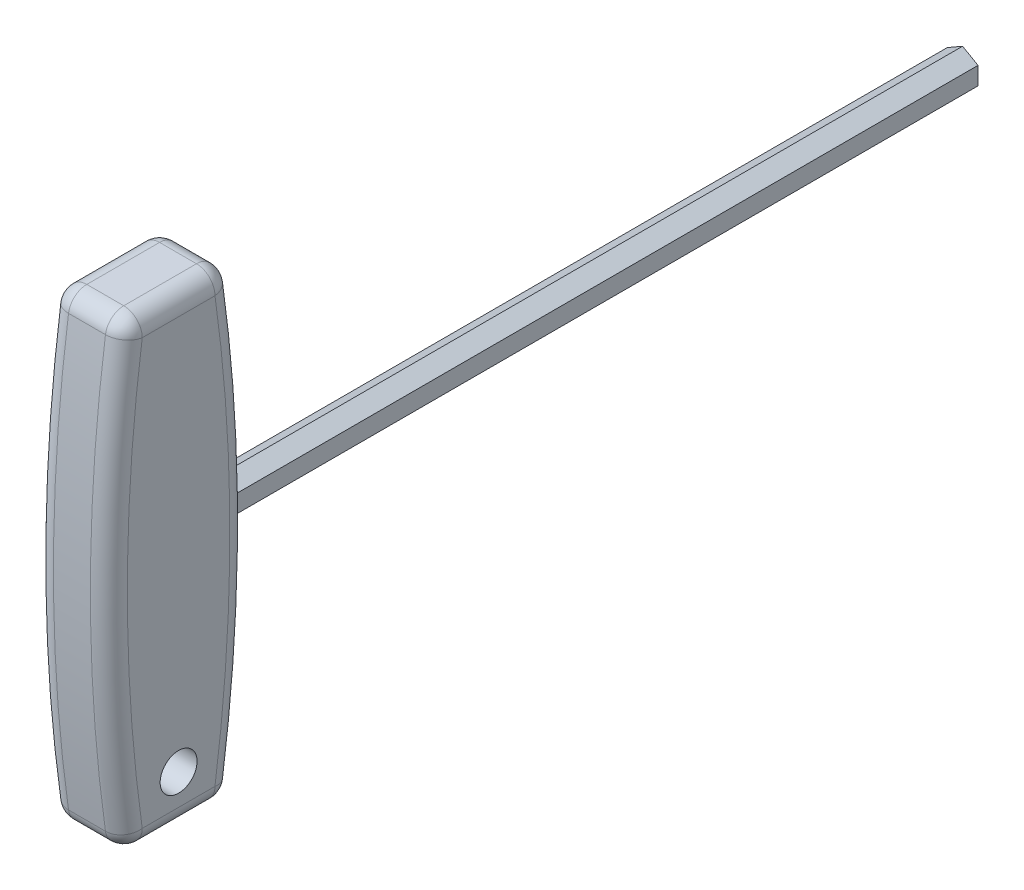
ISO-10303-21;
HEADER;
FILE_DESCRIPTION(('STEP AP214'),'2;1');
FILE_NAME('part.step','',(''),(''),'','','');
FILE_SCHEMA(('AUTOMOTIVE_DESIGN { 1 0 10303 214 1 1 1 1 }'));
ENDSEC;
DATA;
#1=APPLICATION_CONTEXT('core data for automotive mechanical design processes');
#2=APPLICATION_PROTOCOL_DEFINITION('international standard','automotive_design',2000,#1);
#3=PRODUCT_CONTEXT('',#1,'mechanical');
#4=PRODUCT('Part','Part','',(#3));
#5=PRODUCT_RELATED_PRODUCT_CATEGORY('part','',(#4));
#6=PRODUCT_DEFINITION_FORMATION('','',#4);
#7=PRODUCT_DEFINITION_CONTEXT('part definition',#1,'design');
#8=PRODUCT_DEFINITION('design','',#6,#7);
#9=PRODUCT_DEFINITION_SHAPE('','',#8);
#10=(LENGTH_UNIT() NAMED_UNIT(*) SI_UNIT(.MILLI.,.METRE.));
#11=(NAMED_UNIT(*) PLANE_ANGLE_UNIT() SI_UNIT($,.RADIAN.));
#12=(NAMED_UNIT(*) SI_UNIT($,.STERADIAN.) SOLID_ANGLE_UNIT());
#13=UNCERTAINTY_MEASURE_WITH_UNIT(LENGTH_MEASURE(1.E-05),#10,'distance_accuracy_value','');
#14=(GEOMETRIC_REPRESENTATION_CONTEXT(3) GLOBAL_UNCERTAINTY_ASSIGNED_CONTEXT((#13)) GLOBAL_UNIT_ASSIGNED_CONTEXT((#10,
#11,#12)) REPRESENTATION_CONTEXT('',''));
#15=CARTESIAN_POINT('',(0.,0.,0.));
#16=DIRECTION('',(0.,0.,1.));
#17=DIRECTION('',(1.,0.,0.));
#18=AXIS2_PLACEMENT_3D('',#15,#16,#17);
#19=CARTESIAN_POINT('',(0.,0.,0.));
#20=DIRECTION('',(0.,0.,1.));
#21=DIRECTION('',(1.,0.,0.));
#22=AXIS2_PLACEMENT_3D('',#19,#20,#21);
#23=PLANE('',#22);
#24=DIRECTION('',(-0.866025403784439,-0.5,0.));
#25=VECTOR('',#24,1.);
#26=CARTESIAN_POINT('',(-2.5,1.44337567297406,0.));
#27=LINE('',#26,#25);
#28=CARTESIAN_POINT('',(0.,2.88675134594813,0.));
#29=VERTEX_POINT('',#28);
#30=CARTESIAN_POINT('',(-2.5,1.44337567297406,0.));
#31=VERTEX_POINT('',#30);
#32=EDGE_CURVE('E144',#29,#31,#27,.T.);
#33=ORIENTED_EDGE('',*,*,#32,.F.);
#34=DIRECTION('',(-0.866025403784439,0.5,0.));
#35=VECTOR('',#34,1.);
#36=CARTESIAN_POINT('',(0.,2.88675134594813,0.));
#37=LINE('',#36,#35);
#38=CARTESIAN_POINT('',(2.5,1.44337567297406,0.));
#39=VERTEX_POINT('',#38);
#40=EDGE_CURVE('E312',#39,#29,#37,.T.);
#41=ORIENTED_EDGE('',*,*,#40,.F.);
#42=DIRECTION('',(0.,1.,0.));
#43=VECTOR('',#42,1.);
#44=CARTESIAN_POINT('',(2.5,1.44337567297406,0.));
#45=LINE('',#44,#43);
#46=CARTESIAN_POINT('',(2.5,-1.44337567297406,0.));
#47=VERTEX_POINT('',#46);
#48=EDGE_CURVE('E316',#47,#39,#45,.T.);
#49=ORIENTED_EDGE('',*,*,#48,.F.);
#50=DIRECTION('',(0.866025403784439,0.5,0.));
#51=VECTOR('',#50,1.);
#52=CARTESIAN_POINT('',(2.5,-1.44337567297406,0.));
#53=LINE('',#52,#51);
#54=CARTESIAN_POINT('',(0.,-2.88675134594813,0.));
#55=VERTEX_POINT('',#54);
#56=EDGE_CURVE('E320',#55,#47,#53,.T.);
#57=ORIENTED_EDGE('',*,*,#56,.F.);
#58=DIRECTION('',(0.866025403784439,-0.5,0.));
#59=VECTOR('',#58,1.);
#60=CARTESIAN_POINT('',(0.,-2.88675134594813,0.));
#61=LINE('',#60,#59);
#62=CARTESIAN_POINT('',(-2.5,-1.44337567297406,0.));
#63=VERTEX_POINT('',#62);
#64=EDGE_CURVE('E324',#63,#55,#61,.T.);
#65=ORIENTED_EDGE('',*,*,#64,.F.);
#66=DIRECTION('',(0.,1.,0.));
#67=VECTOR('',#66,1.);
#68=CARTESIAN_POINT('',(-2.5,-1.44337567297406,0.));
#69=LINE('',#68,#67);
#70=EDGE_CURVE('E147',#31,#63,#69,.F.);
#71=ORIENTED_EDGE('',*,*,#70,.F.);
#72=EDGE_LOOP('',(#33,#41,#49,#57,#65,#71));
#73=FACE_BOUND('',#72,.T.);
#74=ADVANCED_FACE('F15',(#73),#23,.F.);
#75=CARTESIAN_POINT('',(-3.,-34.4999999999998,127.404449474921));
#76=DIRECTION('',(1.,0.,0.));
#77=DIRECTION('',(0.,1.,0.));
#78=AXIS2_PLACEMENT_3D('',#75,#76,#77);
#79=SPHERICAL_SURFACE('',#78,3.);
#80=CARTESIAN_POINT('',(-3.,-34.4999999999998,127.404449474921));
#81=DIRECTION('',(-1.,0.,0.));
#82=DIRECTION('',(0.,0.,1.));
#83=AXIS2_PLACEMENT_3D('',#80,#81,#82);
#84=CIRCLE('',#83,3.);
#85=CARTESIAN_POINT('',(-3.,-37.4999999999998,127.404449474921));
#86=VERTEX_POINT('',#85);
#87=CARTESIAN_POINT('',(-3.,-34.9190000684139,124.433853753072));
#88=VERTEX_POINT('',#87);
#89=EDGE_CURVE('E326',#86,#88,#84,.F.);
#90=ORIENTED_EDGE('',*,*,#89,.F.);
#91=CARTESIAN_POINT('',(-3.,-34.4999999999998,127.404449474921));
#92=DIRECTION('',(0.,0.,-1.));
#93=DIRECTION('',(-1.,0.,0.));
#94=AXIS2_PLACEMENT_3D('',#91,#92,#93);
#95=CIRCLE('',#94,3.);
#96=CARTESIAN_POINT('',(-6.,-34.4999999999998,127.404449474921));
#97=VERTEX_POINT('',#96);
#98=EDGE_CURVE('E292',#97,#86,#95,.F.);
#99=ORIENTED_EDGE('',*,*,#98,.F.);
#100=CARTESIAN_POINT('',(-3.,-34.4999999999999,127.404449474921));
#101=DIRECTION('',(0.,0.990198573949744,-0.139666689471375));
#102=DIRECTION('',(0.,-0.139666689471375,-0.990198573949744));
#103=AXIS2_PLACEMENT_3D('',#100,#101,#102);
#104=CIRCLE('',#103,3.);
#105=EDGE_CURVE('E258',#88,#97,#104,.T.);
#106=ORIENTED_EDGE('',*,*,#105,.F.);
#107=EDGE_LOOP('',(#90,#99,#106));
#108=FACE_BOUND('',#107,.T.);
#109=ADVANCED_FACE('F356',(#108),#79,.T.);
#110=CARTESIAN_POINT('',(-3.,34.5000000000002,127.404449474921));
#111=DIRECTION('',(1.,0.,0.));
#112=DIRECTION('',(0.,1.,0.));
#113=AXIS2_PLACEMENT_3D('',#110,#111,#112);
#114=SPHERICAL_SURFACE('',#113,2.99999999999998);
#115=CARTESIAN_POINT('',(-3.,34.5000000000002,127.404449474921));
#116=DIRECTION('',(1.,0.,0.));
#117=DIRECTION('',(0.,0.,-1.));
#118=AXIS2_PLACEMENT_3D('',#115,#116,#117);
#119=CIRCLE('',#118,3.);
#120=CARTESIAN_POINT('',(-3.,34.9190000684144,124.433853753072));
#121=VERTEX_POINT('',#120);
#122=CARTESIAN_POINT('',(-3.,37.5000000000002,127.404449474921));
#123=VERTEX_POINT('',#122);
#124=EDGE_CURVE('E300',#121,#123,#119,.T.);
#125=ORIENTED_EDGE('',*,*,#124,.F.);
#126=CARTESIAN_POINT('',(-3.,34.5000000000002,127.404449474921));
#127=DIRECTION('',(0.,0.990198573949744,0.139666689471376));
#128=DIRECTION('',(0.,0.139666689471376,-0.990198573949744));
#129=AXIS2_PLACEMENT_3D('',#126,#127,#128);
#130=CIRCLE('',#129,3.);
#131=CARTESIAN_POINT('',(-6.,34.5000000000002,127.404449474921));
#132=VERTEX_POINT('',#131);
#133=EDGE_CURVE('E282',#132,#121,#130,.F.);
#134=ORIENTED_EDGE('',*,*,#133,.F.);
#135=CARTESIAN_POINT('',(-3.,34.5000000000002,127.404449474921));
#136=DIRECTION('',(0.,0.,1.));
#137=DIRECTION('',(1.,0.,0.));
#138=AXIS2_PLACEMENT_3D('',#135,#136,#137);
#139=CIRCLE('',#138,3.);
#140=EDGE_CURVE('E248',#123,#132,#139,.T.);
#141=ORIENTED_EDGE('',*,*,#140,.F.);
#142=EDGE_LOOP('',(#125,#134,#141));
#143=FACE_BOUND('',#142,.T.);
#144=ADVANCED_FACE('F353',(#143),#114,.T.);
#145=CARTESIAN_POINT('',(-3.,-34.4999999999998,139.21883856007));
#146=DIRECTION('',(1.,0.,0.));
#147=DIRECTION('',(0.,1.,0.));
#148=AXIS2_PLACEMENT_3D('',#145,#146,#147);
#149=SPHERICAL_SURFACE('',#148,2.99999999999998);
#150=CARTESIAN_POINT('',(-3.,-34.4999999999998,139.21883856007));
#151=DIRECTION('',(1.,0.,0.));
#152=DIRECTION('',(0.,0.,-1.));
#153=AXIS2_PLACEMENT_3D('',#150,#151,#152);
#154=CIRCLE('',#153,3.);
#155=CARTESIAN_POINT('',(-3.,-34.9190000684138,142.189434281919));
#156=VERTEX_POINT('',#155);
#157=CARTESIAN_POINT('',(-3.,-37.4999999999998,139.21883856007));
#158=VERTEX_POINT('',#157);
#159=EDGE_CURVE('E329',#156,#158,#154,.T.);
#160=ORIENTED_EDGE('',*,*,#159,.F.);
#161=CARTESIAN_POINT('',(-3.,-34.4999999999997,139.21883856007));
#162=DIRECTION('',(0.,-0.990198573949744,-0.139666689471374));
#163=DIRECTION('',(0.,-0.139666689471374,0.990198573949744));
#164=AXIS2_PLACEMENT_3D('',#161,#162,#163);
#165=CIRCLE('',#164,3.);
#166=CARTESIAN_POINT('',(-6.,-34.4999999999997,139.21883856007));
#167=VERTEX_POINT('',#166);
#168=EDGE_CURVE('E243',#167,#156,#165,.F.);
#169=ORIENTED_EDGE('',*,*,#168,.F.);
#170=CARTESIAN_POINT('',(-3.,-34.4999999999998,139.21883856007));
#171=DIRECTION('',(0.,0.,-1.));
#172=DIRECTION('',(-1.,0.,0.));
#173=AXIS2_PLACEMENT_3D('',#170,#171,#172);
#174=CIRCLE('',#173,3.);
#175=EDGE_CURVE('E287',#158,#167,#174,.T.);
#176=ORIENTED_EDGE('',*,*,#175,.F.);
#177=EDGE_LOOP('',(#160,#169,#176));
#178=FACE_BOUND('',#177,.T.);
#179=ADVANCED_FACE('F348',(#178),#149,.T.);
#180=CARTESIAN_POINT('',(-3.,34.5000000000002,139.21883856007));
#181=DIRECTION('',(1.,0.,0.));
#182=DIRECTION('',(0.,1.,0.));
#183=AXIS2_PLACEMENT_3D('',#180,#181,#182);
#184=SPHERICAL_SURFACE('',#183,3.);
#185=CARTESIAN_POINT('',(-3.,34.5000000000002,139.21883856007));
#186=DIRECTION('',(1.,0.,0.));
#187=DIRECTION('',(0.,0.,-1.));
#188=AXIS2_PLACEMENT_3D('',#185,#186,#187);
#189=CIRCLE('',#188,3.);
#190=CARTESIAN_POINT('',(-3.,37.5000000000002,139.21883856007));
#191=VERTEX_POINT('',#190);
#192=CARTESIAN_POINT('',(-3.,34.9190000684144,142.189434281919));
#193=VERTEX_POINT('',#192);
#194=EDGE_CURVE('E297',#191,#193,#189,.T.);
#195=ORIENTED_EDGE('',*,*,#194,.F.);
#196=CARTESIAN_POINT('',(-3.,34.5000000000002,139.21883856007));
#197=DIRECTION('',(0.,0.,1.));
#198=DIRECTION('',(1.,0.,0.));
#199=AXIS2_PLACEMENT_3D('',#196,#197,#198);
#200=CIRCLE('',#199,3.);
#201=CARTESIAN_POINT('',(-6.,34.5000000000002,139.21883856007));
#202=VERTEX_POINT('',#201);
#203=EDGE_CURVE('E253',#202,#191,#200,.F.);
#204=ORIENTED_EDGE('',*,*,#203,.F.);
#205=CARTESIAN_POINT('',(-3.,34.5000000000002,139.21883856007));
#206=DIRECTION('',(0.,-0.990198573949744,0.139666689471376));
#207=DIRECTION('',(0.,0.139666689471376,0.990198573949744));
#208=AXIS2_PLACEMENT_3D('',#205,#206,#207);
#209=CIRCLE('',#208,3.);
#210=EDGE_CURVE('E221',#193,#202,#209,.T.);
#211=ORIENTED_EDGE('',*,*,#210,.F.);
#212=EDGE_LOOP('',(#195,#204,#211));
#213=FACE_BOUND('',#212,.T.);
#214=ADVANCED_FACE('F343',(#213),#184,.T.);
#215=CARTESIAN_POINT('',(0.,-34.4999999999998,139.21883856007));
#216=DIRECTION('',(1.,0.,0.));
#217=DIRECTION('',(0.,0.,-1.));
#218=AXIS2_PLACEMENT_3D('',#215,#216,#217);
#219=CYLINDRICAL_SURFACE('',#218,3.);
#220=ORIENTED_EDGE('',*,*,#159,.T.);
#221=DIRECTION('',(1.,0.,0.));
#222=VECTOR('',#221,1.);
#223=CARTESIAN_POINT('',(0.,-37.4999999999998,139.21883856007));
#224=LINE('',#223,#222);
#225=CARTESIAN_POINT('',(3.,-37.4999999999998,139.21883856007));
#226=VERTEX_POINT('',#225);
#227=EDGE_CURVE('E204',#226,#158,#224,.F.);
#228=ORIENTED_EDGE('',*,*,#227,.F.);
#229=CARTESIAN_POINT('',(3.,-34.4999999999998,139.21883856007));
#230=DIRECTION('',(1.,0.,0.));
#231=DIRECTION('',(0.,1.,0.));
#232=AXIS2_PLACEMENT_3D('',#229,#230,#231);
#233=CIRCLE('',#232,3.);
#234=CARTESIAN_POINT('',(3.,-34.9190000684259,142.189434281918));
#235=VERTEX_POINT('',#234);
#236=EDGE_CURVE('E206',#235,#226,#233,.T.);
#237=ORIENTED_EDGE('',*,*,#236,.F.);
#238=DIRECTION('',(1.,0.,0.));
#239=VECTOR('',#238,1.);
#240=CARTESIAN_POINT('',(0.,-34.9190000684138,142.189434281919));
#241=LINE('',#240,#239);
#242=EDGE_CURVE('E209',#156,#235,#241,.T.);
#243=ORIENTED_EDGE('',*,*,#242,.F.);
#244=EDGE_LOOP('',(#220,#228,#237,#243));
#245=FACE_BOUND('',#244,.T.);
#246=ADVANCED_FACE('F347',(#245),#219,.T.);
#247=CARTESIAN_POINT('',(0.,-34.4999999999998,127.404449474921));
#248=DIRECTION('',(-1.,0.,0.));
#249=DIRECTION('',(0.,0.,1.));
#250=AXIS2_PLACEMENT_3D('',#247,#248,#249);
#251=CYLINDRICAL_SURFACE('',#250,3.);
#252=CARTESIAN_POINT('',(3.,-34.4999999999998,127.404449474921));
#253=DIRECTION('',(1.,0.,0.));
#254=DIRECTION('',(0.,1.,0.));
#255=AXIS2_PLACEMENT_3D('',#252,#253,#254);
#256=CIRCLE('',#255,3.);
#257=CARTESIAN_POINT('',(3.,-37.4999999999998,127.404449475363));
#258=VERTEX_POINT('',#257);
#259=CARTESIAN_POINT('',(3.,-34.9190000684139,124.433853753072));
#260=VERTEX_POINT('',#259);
#261=EDGE_CURVE('E179',#258,#260,#256,.T.);
#262=ORIENTED_EDGE('',*,*,#261,.F.);
#263=DIRECTION('',(1.,0.,0.));
#264=VECTOR('',#263,1.);
#265=CARTESIAN_POINT('',(0.,-37.4999999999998,127.404449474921));
#266=LINE('',#265,#264);
#267=EDGE_CURVE('E333',#86,#258,#266,.T.);
#268=ORIENTED_EDGE('',*,*,#267,.F.);
#269=ORIENTED_EDGE('',*,*,#89,.T.);
#270=DIRECTION('',(1.,0.,0.));
#271=VECTOR('',#270,1.);
#272=CARTESIAN_POINT('',(0.,-34.9190000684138,124.433853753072));
#273=LINE('',#272,#271);
#274=EDGE_CURVE('E171',#260,#88,#273,.F.);
#275=ORIENTED_EDGE('',*,*,#274,.F.);
#276=EDGE_LOOP('',(#262,#268,#269,#275));
#277=FACE_BOUND('',#276,.T.);
#278=ADVANCED_FACE('F596',(#277),#251,.T.);
#279=CARTESIAN_POINT('',(-2.5,1.44337567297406,0.));
#280=DIRECTION('',(-0.5,0.866025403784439,0.));
#281=DIRECTION('',(-0.866025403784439,-0.5,0.));
#282=AXIS2_PLACEMENT_3D('',#279,#280,#281);
#283=PLANE('',#282);
#284=ORIENTED_EDGE('',*,*,#32,.T.);
#285=DIRECTION('',(0.,0.,1.));
#286=VECTOR('',#285,1.);
#287=CARTESIAN_POINT('',(-2.5,1.44337567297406,0.));
#288=LINE('',#287,#286);
#289=CARTESIAN_POINT('',(-2.5,1.44337567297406,121.987500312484));
#290=VERTEX_POINT('',#289);
#291=EDGE_CURVE('E141',#290,#31,#288,.F.);
#292=ORIENTED_EDGE('',*,*,#291,.F.);
#293=CARTESIAN_POINT('',(-5.,0.,372.));
#294=DIRECTION('',(-0.5,0.866025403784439,0.));
#295=DIRECTION('',(0.866025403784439,0.5,0.));
#296=AXIS2_PLACEMENT_3D('',#293,#294,#295);
#297=ELLIPSE('',#296,500.033332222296,250.016666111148);
#298=CARTESIAN_POINT('',(0.,2.88675134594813,122.));
#299=VERTEX_POINT('',#298);
#300=EDGE_CURVE('E18',#299,#290,#297,.T.);
#301=ORIENTED_EDGE('',*,*,#300,.F.);
#302=DIRECTION('',(0.,0.,1.));
#303=VECTOR('',#302,1.);
#304=CARTESIAN_POINT('',(0.,2.88675134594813,0.));
#305=LINE('',#304,#303);
#306=EDGE_CURVE('E303',#29,#299,#305,.T.);
#307=ORIENTED_EDGE('',*,*,#306,.F.);
#308=EDGE_LOOP('',(#284,#292,#301,#307));
#309=FACE_BOUND('',#308,.T.);
#310=ADVANCED_FACE('F143',(#309),#283,.T.);
#311=CARTESIAN_POINT('',(-2.5,-1.44337567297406,0.));
#312=DIRECTION('',(-1.,0.,0.));
#313=DIRECTION('',(0.,0.,1.));
#314=AXIS2_PLACEMENT_3D('',#311,#312,#313);
#315=PLANE('',#314);
#316=ORIENTED_EDGE('',*,*,#70,.T.);
#317=DIRECTION('',(0.,0.,1.));
#318=VECTOR('',#317,1.);
#319=CARTESIAN_POINT('',(-2.5,-1.44337567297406,0.));
#320=LINE('',#319,#318);
#321=CARTESIAN_POINT('',(-2.5,-1.44337567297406,121.987500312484));
#322=VERTEX_POINT('',#321);
#323=EDGE_CURVE('E153',#322,#63,#320,.F.);
#324=ORIENTED_EDGE('',*,*,#323,.F.);
#325=CARTESIAN_POINT('',(-2.5,0.,372.));
#326=DIRECTION('',(1.,0.,0.));
#327=DIRECTION('',(0.,0.,-1.));
#328=AXIS2_PLACEMENT_3D('',#325,#326,#327);
#329=CIRCLE('',#328,250.016666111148);
#330=EDGE_CURVE('E150',#290,#322,#329,.F.);
#331=ORIENTED_EDGE('',*,*,#330,.F.);
#332=ORIENTED_EDGE('',*,*,#291,.T.);
#333=EDGE_LOOP('',(#316,#324,#331,#332));
#334=FACE_BOUND('',#333,.T.);
#335=ADVANCED_FACE('F151',(#334),#315,.T.);
#336=CARTESIAN_POINT('',(0.,-2.88675134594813,0.));
#337=DIRECTION('',(-0.5,-0.866025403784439,0.));
#338=DIRECTION('',(0.866025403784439,-0.5,0.));
#339=AXIS2_PLACEMENT_3D('',#336,#337,#338);
#340=PLANE('',#339);
#341=ORIENTED_EDGE('',*,*,#64,.T.);
#342=DIRECTION('',(0.,0.,1.));
#343=VECTOR('',#342,1.);
#344=CARTESIAN_POINT('',(0.,-2.88675134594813,0.));
#345=LINE('',#344,#343);
#346=CARTESIAN_POINT('',(0.,-2.88675134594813,122.));
#347=VERTEX_POINT('',#346);
#348=EDGE_CURVE('E321',#347,#55,#345,.F.);
#349=ORIENTED_EDGE('',*,*,#348,.F.);
#350=CARTESIAN_POINT('',(-5.,0.,372.));
#351=DIRECTION('',(-0.5,-0.866025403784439,0.));
#352=DIRECTION('',(0.866025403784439,-0.5,0.));
#353=AXIS2_PLACEMENT_3D('',#350,#351,#352);
#354=ELLIPSE('',#353,500.033332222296,250.016666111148);
#355=EDGE_CURVE('E157',#322,#347,#354,.T.);
#356=ORIENTED_EDGE('',*,*,#355,.F.);
#357=ORIENTED_EDGE('',*,*,#323,.T.);
#358=EDGE_LOOP('',(#341,#349,#356,#357));
#359=FACE_BOUND('',#358,.T.);
#360=ADVANCED_FACE('F383',(#359),#340,.T.);
#361=CARTESIAN_POINT('',(2.5,-1.44337567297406,0.));
#362=DIRECTION('',(0.5,-0.866025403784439,0.));
#363=DIRECTION('',(0.866025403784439,0.5,0.));
#364=AXIS2_PLACEMENT_3D('',#361,#362,#363);
#365=PLANE('',#364);
#366=ORIENTED_EDGE('',*,*,#56,.T.);
#367=DIRECTION('',(0.,0.,-1.));
#368=VECTOR('',#367,1.);
#369=CARTESIAN_POINT('',(2.5,-1.44337567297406,0.));
#370=LINE('',#369,#368);
#371=CARTESIAN_POINT('',(2.5,-1.44337567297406,121.987500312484));
#372=VERTEX_POINT('',#371);
#373=EDGE_CURVE('E317',#372,#47,#370,.T.);
#374=ORIENTED_EDGE('',*,*,#373,.F.);
#375=CARTESIAN_POINT('',(5.,0.,372.));
#376=DIRECTION('',(0.5,-0.866025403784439,0.));
#377=DIRECTION('',(0.866025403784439,0.5,0.));
#378=AXIS2_PLACEMENT_3D('',#375,#376,#377);
#379=ELLIPSE('',#378,500.033332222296,250.016666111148);
#380=EDGE_CURVE('E378',#347,#372,#379,.T.);
#381=ORIENTED_EDGE('',*,*,#380,.F.);
#382=ORIENTED_EDGE('',*,*,#348,.T.);
#383=EDGE_LOOP('',(#366,#374,#381,#382));
#384=FACE_BOUND('',#383,.T.);
#385=ADVANCED_FACE('F387',(#384),#365,.T.);
#386=CARTESIAN_POINT('',(2.5,1.44337567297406,0.));
#387=DIRECTION('',(1.,0.,0.));
#388=DIRECTION('',(0.,0.,-1.));
#389=AXIS2_PLACEMENT_3D('',#386,#387,#388);
#390=PLANE('',#389);
#391=ORIENTED_EDGE('',*,*,#48,.T.);
#392=DIRECTION('',(0.,0.,1.));
#393=VECTOR('',#392,1.);
#394=CARTESIAN_POINT('',(2.5,1.44337567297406,0.));
#395=LINE('',#394,#393);
#396=CARTESIAN_POINT('',(2.5,1.44337567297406,121.987500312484));
#397=VERTEX_POINT('',#396);
#398=EDGE_CURVE('E313',#397,#39,#395,.F.);
#399=ORIENTED_EDGE('',*,*,#398,.F.);
#400=CARTESIAN_POINT('',(2.5,0.,372.));
#401=DIRECTION('',(1.,0.,0.));
#402=DIRECTION('',(0.,0.,-1.));
#403=AXIS2_PLACEMENT_3D('',#400,#401,#402);
#404=CIRCLE('',#403,250.016666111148);
#405=EDGE_CURVE('E376',#372,#397,#404,.T.);
#406=ORIENTED_EDGE('',*,*,#405,.F.);
#407=ORIENTED_EDGE('',*,*,#373,.T.);
#408=EDGE_LOOP('',(#391,#399,#406,#407));
#409=FACE_BOUND('',#408,.T.);
#410=ADVANCED_FACE('F391',(#409),#390,.T.);
#411=CARTESIAN_POINT('',(0.,2.88675134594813,0.));
#412=DIRECTION('',(0.5,0.866025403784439,0.));
#413=DIRECTION('',(-0.866025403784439,0.5,0.));
#414=AXIS2_PLACEMENT_3D('',#411,#412,#413);
#415=PLANE('',#414);
#416=ORIENTED_EDGE('',*,*,#40,.T.);
#417=ORIENTED_EDGE('',*,*,#306,.T.);
#418=CARTESIAN_POINT('',(5.,0.,372.));
#419=DIRECTION('',(0.5,0.866025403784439,0.));
#420=DIRECTION('',(0.866025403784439,-0.5,0.));
#421=AXIS2_PLACEMENT_3D('',#418,#419,#420);
#422=ELLIPSE('',#421,500.033332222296,250.016666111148);
#423=EDGE_CURVE('E163',#397,#299,#422,.T.);
#424=ORIENTED_EDGE('',*,*,#423,.F.);
#425=ORIENTED_EDGE('',*,*,#398,.T.);
#426=EDGE_LOOP('',(#416,#417,#424,#425));
#427=FACE_BOUND('',#426,.T.);
#428=ADVANCED_FACE('F394',(#427),#415,.T.);
#429=CARTESIAN_POINT('',(0.,34.5000000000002,127.404449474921));
#430=DIRECTION('',(1.,0.,0.));
#431=DIRECTION('',(0.,0.,-1.));
#432=AXIS2_PLACEMENT_3D('',#429,#430,#431);
#433=CYLINDRICAL_SURFACE('',#432,3.);
#434=ORIENTED_EDGE('',*,*,#124,.T.);
#435=DIRECTION('',(1.,0.,0.));
#436=VECTOR('',#435,1.);
#437=CARTESIAN_POINT('',(0.,37.5000000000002,127.404449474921));
#438=LINE('',#437,#436);
#439=CARTESIAN_POINT('',(3.,37.5000000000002,127.404449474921));
#440=VERTEX_POINT('',#439);
#441=EDGE_CURVE('E308',#440,#123,#438,.F.);
#442=ORIENTED_EDGE('',*,*,#441,.F.);
#443=CARTESIAN_POINT('',(3.,34.5000000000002,127.404449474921));
#444=DIRECTION('',(1.,0.,0.));
#445=DIRECTION('',(0.,1.,0.));
#446=AXIS2_PLACEMENT_3D('',#443,#444,#445);
#447=CIRCLE('',#446,3.);
#448=CARTESIAN_POINT('',(3.,34.919000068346,124.433853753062));
#449=VERTEX_POINT('',#448);
#450=EDGE_CURVE('E375',#449,#440,#447,.T.);
#451=ORIENTED_EDGE('',*,*,#450,.F.);
#452=DIRECTION('',(1.,0.,0.));
#453=VECTOR('',#452,1.);
#454=CARTESIAN_POINT('',(0.,34.9190000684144,124.433853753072));
#455=LINE('',#454,#453);
#456=EDGE_CURVE('E164',#121,#449,#455,.T.);
#457=ORIENTED_EDGE('',*,*,#456,.F.);
#458=EDGE_LOOP('',(#434,#442,#451,#457));
#459=FACE_BOUND('',#458,.T.);
#460=ADVANCED_FACE('F580',(#459),#433,.T.);
#461=CARTESIAN_POINT('',(0.,34.5000000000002,139.21883856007));
#462=DIRECTION('',(1.,0.,0.));
#463=DIRECTION('',(0.,0.,-1.));
#464=AXIS2_PLACEMENT_3D('',#461,#462,#463);
#465=CYLINDRICAL_SURFACE('',#464,3.);
#466=ORIENTED_EDGE('',*,*,#194,.T.);
#467=DIRECTION('',(1.,0.,0.));
#468=VECTOR('',#467,1.);
#469=CARTESIAN_POINT('',(0.,34.9190000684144,142.189434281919));
#470=LINE('',#469,#468);
#471=CARTESIAN_POINT('',(3.,34.9190000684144,142.189434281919));
#472=VERTEX_POINT('',#471);
#473=EDGE_CURVE('E218',#472,#193,#470,.F.);
#474=ORIENTED_EDGE('',*,*,#473,.F.);
#475=CARTESIAN_POINT('',(3.,34.5000000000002,139.21883856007));
#476=DIRECTION('',(1.,0.,0.));
#477=DIRECTION('',(0.,1.,0.));
#478=AXIS2_PLACEMENT_3D('',#475,#476,#477);
#479=CIRCLE('',#478,3.);
#480=CARTESIAN_POINT('',(3.,37.5000000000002,139.21883856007));
#481=VERTEX_POINT('',#480);
#482=EDGE_CURVE('E307',#481,#472,#479,.T.);
#483=ORIENTED_EDGE('',*,*,#482,.F.);
#484=DIRECTION('',(1.,0.,0.));
#485=VECTOR('',#484,1.);
#486=CARTESIAN_POINT('',(0.,37.5000000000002,139.21883856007));
#487=LINE('',#486,#485);
#488=EDGE_CURVE('E569',#191,#481,#487,.T.);
#489=ORIENTED_EDGE('',*,*,#488,.F.);
#490=EDGE_LOOP('',(#466,#474,#483,#489));
#491=FACE_BOUND('',#490,.T.);
#492=ADVANCED_FACE('F584',(#491),#465,.T.);
#493=CARTESIAN_POINT('',(-3.,-34.4999999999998,129.061644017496));
#494=DIRECTION('',(0.,0.,-1.));
#495=DIRECTION('',(-1.,0.,0.));
#496=AXIS2_PLACEMENT_3D('',#493,#494,#495);
#497=CYLINDRICAL_SURFACE('',#496,3.);
#498=ORIENTED_EDGE('',*,*,#175,.T.);
#499=DIRECTION('',(0.,0.,-1.));
#500=VECTOR('',#499,1.);
#501=CARTESIAN_POINT('',(-6.,-34.4999999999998,133.311644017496));
#502=LINE('',#501,#500);
#503=EDGE_CURVE('E548',#167,#97,#502,.T.);
#504=ORIENTED_EDGE('',*,*,#503,.T.);
#505=ORIENTED_EDGE('',*,*,#98,.T.);
#506=DIRECTION('',(0.,0.,-1.));
#507=VECTOR('',#506,1.);
#508=CARTESIAN_POINT('',(-3.,-37.4999999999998,124.811644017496));
#509=LINE('',#508,#507);
#510=EDGE_CURVE('E330',#158,#86,#509,.T.);
#511=ORIENTED_EDGE('',*,*,#510,.F.);
#512=EDGE_LOOP('',(#498,#504,#505,#511));
#513=FACE_BOUND('',#512,.T.);
#514=ADVANCED_FACE('F269',(#513),#497,.T.);
#515=CARTESIAN_POINT('',(-3.,0.,372.));
#516=DIRECTION('',(1.,0.,0.));
#517=DIRECTION('',(0.,0.,-1.));
#518=AXIS2_PLACEMENT_3D('',#515,#516,#517);
#519=TOROIDAL_SURFACE('',#518,247.016666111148,3.);
#520=ORIENTED_EDGE('',*,*,#105,.T.);
#521=CARTESIAN_POINT('',(-6.,0.,372.));
#522=DIRECTION('',(1.,0.,0.));
#523=DIRECTION('',(0.,-0.139666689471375,-0.990198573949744));
#524=AXIS2_PLACEMENT_3D('',#521,#522,#523);
#525=CIRCLE('',#524,247.016666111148);
#526=EDGE_CURVE('E524',#97,#132,#525,.T.);
#527=ORIENTED_EDGE('',*,*,#526,.T.);
#528=ORIENTED_EDGE('',*,*,#133,.T.);
#529=CARTESIAN_POINT('',(-3.,0.,372.));
#530=DIRECTION('',(1.,0.,0.));
#531=DIRECTION('',(0.,0.,-1.));
#532=AXIS2_PLACEMENT_3D('',#529,#530,#531);
#533=CIRCLE('',#532,250.016666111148);
#534=EDGE_CURVE('E166',#88,#121,#533,.T.);
#535=ORIENTED_EDGE('',*,*,#534,.F.);
#536=EDGE_LOOP('',(#520,#527,#528,#535));
#537=FACE_BOUND('',#536,.T.);
#538=ADVANCED_FACE('F265',(#537),#519,.T.);
#539=CARTESIAN_POINT('',(-3.,34.5000000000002,137.561644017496));
#540=DIRECTION('',(0.,0.,1.));
#541=DIRECTION('',(1.,0.,0.));
#542=AXIS2_PLACEMENT_3D('',#539,#540,#541);
#543=CYLINDRICAL_SURFACE('',#542,3.);
#544=ORIENTED_EDGE('',*,*,#140,.T.);
#545=DIRECTION('',(0.,0.,-1.));
#546=VECTOR('',#545,1.);
#547=CARTESIAN_POINT('',(-6.,34.5000000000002,133.311644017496));
#548=LINE('',#547,#546);
#549=EDGE_CURVE('E538',#132,#202,#548,.F.);
#550=ORIENTED_EDGE('',*,*,#549,.T.);
#551=ORIENTED_EDGE('',*,*,#203,.T.);
#552=DIRECTION('',(0.,0.,1.));
#553=VECTOR('',#552,1.);
#554=CARTESIAN_POINT('',(-3.,37.5000000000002,141.811644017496));
#555=LINE('',#554,#553);
#556=EDGE_CURVE('E304',#123,#191,#555,.T.);
#557=ORIENTED_EDGE('',*,*,#556,.F.);
#558=EDGE_LOOP('',(#544,#550,#551,#557));
#559=FACE_BOUND('',#558,.T.);
#560=ADVANCED_FACE('F230',(#559),#543,.T.);
#561=CARTESIAN_POINT('',(-3.,0.,-105.376711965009));
#562=DIRECTION('',(1.,0.,0.));
#563=DIRECTION('',(0.,0.,-1.));
#564=AXIS2_PLACEMENT_3D('',#561,#562,#563);
#565=TOROIDAL_SURFACE('',#564,247.016666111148,3.);
#566=ORIENTED_EDGE('',*,*,#210,.T.);
#567=CARTESIAN_POINT('',(-6.,0.,-105.376711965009));
#568=DIRECTION('',(1.,0.,0.));
#569=DIRECTION('',(0.,0.139666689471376,0.990198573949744));
#570=AXIS2_PLACEMENT_3D('',#567,#568,#569);
#571=CIRCLE('',#570,247.016666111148);
#572=EDGE_CURVE('E516',#202,#167,#571,.T.);
#573=ORIENTED_EDGE('',*,*,#572,.T.);
#574=ORIENTED_EDGE('',*,*,#168,.T.);
#575=CARTESIAN_POINT('',(-3.,0.,-105.376711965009));
#576=DIRECTION('',(1.,0.,0.));
#577=DIRECTION('',(0.,0.,-1.));
#578=AXIS2_PLACEMENT_3D('',#575,#576,#577);
#579=CIRCLE('',#578,250.016666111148);
#580=EDGE_CURVE('E217',#193,#156,#579,.T.);
#581=ORIENTED_EDGE('',*,*,#580,.F.);
#582=EDGE_LOOP('',(#566,#573,#574,#581));
#583=FACE_BOUND('',#582,.T.);
#584=ADVANCED_FACE('F226',(#583),#565,.T.);
#585=CARTESIAN_POINT('',(0.,0.,-105.376711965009));
#586=DIRECTION('',(1.,0.,0.));
#587=DIRECTION('',(0.,0.,-1.));
#588=AXIS2_PLACEMENT_3D('',#585,#586,#587);
#589=CYLINDRICAL_SURFACE('',#588,250.016666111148);
#590=ORIENTED_EDGE('',*,*,#580,.T.);
#591=ORIENTED_EDGE('',*,*,#242,.T.);
#592=CARTESIAN_POINT('',(3.,0.,-105.376711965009));
#593=DIRECTION('',(-1.,0.,0.));
#594=DIRECTION('',(0.,0.,1.));
#595=AXIS2_PLACEMENT_3D('',#592,#593,#594);
#596=CIRCLE('',#595,250.016666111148);
#597=EDGE_CURVE('E210',#472,#235,#596,.F.);
#598=ORIENTED_EDGE('',*,*,#597,.F.);
#599=ORIENTED_EDGE('',*,*,#473,.T.);
#600=EDGE_LOOP('',(#590,#591,#598,#599));
#601=FACE_BOUND('',#600,.T.);
#602=ADVANCED_FACE('F198',(#601),#589,.T.);
#603=CARTESIAN_POINT('',(3.,-34.4999999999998,139.21883856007));
#604=DIRECTION('',(1.,0.,0.));
#605=DIRECTION('',(0.,1.,0.));
#606=AXIS2_PLACEMENT_3D('',#603,#604,#605);
#607=SPHERICAL_SURFACE('',#606,3.);
#608=CARTESIAN_POINT('',(3.,-34.4999999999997,139.21883856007));
#609=DIRECTION('',(0.,0.990198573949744,0.139666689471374));
#610=DIRECTION('',(0.,-0.139666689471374,0.990198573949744));
#611=AXIS2_PLACEMENT_3D('',#608,#609,#610);
#612=CIRCLE('',#611,3.);
#613=CARTESIAN_POINT('',(6.,-34.4999999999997,139.21883856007));
#614=VERTEX_POINT('',#613);
#615=EDGE_CURVE('E213',#235,#614,#612,.T.);
#616=ORIENTED_EDGE('',*,*,#615,.F.);
#617=ORIENTED_EDGE('',*,*,#236,.T.);
#618=CARTESIAN_POINT('',(3.,-34.4999999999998,139.21883856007));
#619=DIRECTION('',(0.,0.,1.));
#620=DIRECTION('',(1.,0.,0.));
#621=AXIS2_PLACEMENT_3D('',#618,#619,#620);
#622=CIRCLE('',#621,3.);
#623=EDGE_CURVE('E480',#614,#226,#622,.F.);
#624=ORIENTED_EDGE('',*,*,#623,.F.);
#625=EDGE_LOOP('',(#616,#617,#624));
#626=FACE_BOUND('',#625,.T.);
#627=ADVANCED_FACE('F193',(#626),#607,.T.);
#628=CARTESIAN_POINT('',(0.,-37.4999999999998,124.811644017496));
#629=DIRECTION('',(0.,-1.,0.));
#630=DIRECTION('',(0.,0.,-1.));
#631=AXIS2_PLACEMENT_3D('',#628,#629,#630);
#632=PLANE('',#631);
#633=ORIENTED_EDGE('',*,*,#267,.T.);
#634=DIRECTION('',(0.,0.,1.));
#635=VECTOR('',#634,1.);
#636=CARTESIAN_POINT('',(3.,-37.4999999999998,129.061644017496));
#637=LINE('',#636,#635);
#638=EDGE_CURVE('E483',#226,#258,#637,.F.);
#639=ORIENTED_EDGE('',*,*,#638,.F.);
#640=ORIENTED_EDGE('',*,*,#227,.T.);
#641=ORIENTED_EDGE('',*,*,#510,.T.);
#642=EDGE_LOOP('',(#633,#639,#640,#641));
#643=FACE_BOUND('',#642,.T.);
#644=ADVANCED_FACE('F188',(#643),#632,.T.);
#645=CARTESIAN_POINT('',(3.,-34.4999999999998,127.404449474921));
#646=DIRECTION('',(1.,0.,0.));
#647=DIRECTION('',(0.,1.,0.));
#648=AXIS2_PLACEMENT_3D('',#645,#646,#647);
#649=SPHERICAL_SURFACE('',#648,3.);
#650=CARTESIAN_POINT('',(3.,-34.4999999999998,127.404449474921));
#651=DIRECTION('',(0.,0.,1.));
#652=DIRECTION('',(1.,0.,0.));
#653=AXIS2_PLACEMENT_3D('',#650,#651,#652);
#654=CIRCLE('',#653,3.);
#655=CARTESIAN_POINT('',(6.,-34.4999999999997,127.404449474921));
#656=VERTEX_POINT('',#655);
#657=EDGE_CURVE('E477',#258,#656,#654,.T.);
#658=ORIENTED_EDGE('',*,*,#657,.F.);
#659=ORIENTED_EDGE('',*,*,#261,.T.);
#660=CARTESIAN_POINT('',(3.,-34.4999999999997,127.404449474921));
#661=DIRECTION('',(0.,-0.990198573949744,0.139666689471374));
#662=DIRECTION('',(0.,-0.139666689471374,-0.990198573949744));
#663=AXIS2_PLACEMENT_3D('',#660,#661,#662);
#664=CIRCLE('',#663,3.);
#665=EDGE_CURVE('E474',#656,#260,#664,.F.);
#666=ORIENTED_EDGE('',*,*,#665,.F.);
#667=EDGE_LOOP('',(#658,#659,#666));
#668=FACE_BOUND('',#667,.T.);
#669=ADVANCED_FACE('F184',(#668),#649,.T.);
#670=CARTESIAN_POINT('',(0.,0.,372.));
#671=DIRECTION('',(1.,0.,0.));
#672=DIRECTION('',(0.,0.,-1.));
#673=AXIS2_PLACEMENT_3D('',#670,#671,#672);
#674=CYLINDRICAL_SURFACE('',#673,250.016666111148);
#675=ORIENTED_EDGE('',*,*,#405,.T.);
#676=ORIENTED_EDGE('',*,*,#423,.T.);
#677=ORIENTED_EDGE('',*,*,#300,.T.);
#678=ORIENTED_EDGE('',*,*,#330,.T.);
#679=ORIENTED_EDGE('',*,*,#355,.T.);
#680=ORIENTED_EDGE('',*,*,#380,.T.);
#681=EDGE_LOOP('',(#675,#676,#677,#678,#679,#680));
#682=FACE_BOUND('',#681,.T.);
#683=ORIENTED_EDGE('',*,*,#456,.T.);
#684=CARTESIAN_POINT('',(3.,0.,372.));
#685=DIRECTION('',(-1.,0.,0.));
#686=DIRECTION('',(0.,0.,1.));
#687=AXIS2_PLACEMENT_3D('',#684,#685,#686);
#688=CIRCLE('',#687,250.016666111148);
#689=EDGE_CURVE('E175',#260,#449,#688,.F.);
#690=ORIENTED_EDGE('',*,*,#689,.F.);
#691=ORIENTED_EDGE('',*,*,#274,.T.);
#692=ORIENTED_EDGE('',*,*,#534,.T.);
#693=EDGE_LOOP('',(#683,#690,#691,#692));
#694=FACE_BOUND('',#693,.T.);
#695=ADVANCED_FACE('F160',(#682,#694),#674,.T.);
#696=CARTESIAN_POINT('',(3.,34.5000000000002,127.404449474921));
#697=DIRECTION('',(1.,0.,0.));
#698=DIRECTION('',(0.,1.,0.));
#699=AXIS2_PLACEMENT_3D('',#696,#697,#698);
#700=SPHERICAL_SURFACE('',#699,3.);
#701=CARTESIAN_POINT('',(3.,34.5000000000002,127.404449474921));
#702=DIRECTION('',(0.,0.,-1.));
#703=DIRECTION('',(-1.,0.,0.));
#704=AXIS2_PLACEMENT_3D('',#701,#702,#703);
#705=CIRCLE('',#704,3.);
#706=CARTESIAN_POINT('',(6.,34.5000000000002,127.404449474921));
#707=VERTEX_POINT('',#706);
#708=EDGE_CURVE('E33',#707,#440,#705,.F.);
#709=ORIENTED_EDGE('',*,*,#708,.F.);
#710=CARTESIAN_POINT('',(3.,34.5000000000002,127.404449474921));
#711=DIRECTION('',(0.,-0.990198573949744,-0.139666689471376));
#712=DIRECTION('',(0.,0.139666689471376,-0.990198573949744));
#713=AXIS2_PLACEMENT_3D('',#710,#711,#712);
#714=CIRCLE('',#713,3.);
#715=EDGE_CURVE('E444',#449,#707,#714,.T.);
#716=ORIENTED_EDGE('',*,*,#715,.F.);
#717=ORIENTED_EDGE('',*,*,#450,.T.);
#718=EDGE_LOOP('',(#709,#716,#717));
#719=FACE_BOUND('',#718,.T.);
#720=ADVANCED_FACE('F562',(#719),#700,.T.);
#721=CARTESIAN_POINT('',(0.,37.5000000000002,141.811644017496));
#722=DIRECTION('',(0.,1.,0.));
#723=DIRECTION('',(0.,0.,1.));
#724=AXIS2_PLACEMENT_3D('',#721,#722,#723);
#725=PLANE('',#724);
#726=ORIENTED_EDGE('',*,*,#441,.T.);
#727=ORIENTED_EDGE('',*,*,#556,.T.);
#728=ORIENTED_EDGE('',*,*,#488,.T.);
#729=DIRECTION('',(0.,0.,-1.));
#730=VECTOR('',#729,1.);
#731=CARTESIAN_POINT('',(3.,37.5000000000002,137.561644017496));
#732=LINE('',#731,#730);
#733=EDGE_CURVE('E443',#440,#481,#732,.F.);
#734=ORIENTED_EDGE('',*,*,#733,.F.);
#735=EDGE_LOOP('',(#726,#727,#728,#734));
#736=FACE_BOUND('',#735,.T.);
#737=ADVANCED_FACE('F559',(#736),#725,.T.);
#738=CARTESIAN_POINT('',(3.,34.5000000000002,139.21883856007));
#739=DIRECTION('',(1.,0.,0.));
#740=DIRECTION('',(0.,1.,0.));
#741=AXIS2_PLACEMENT_3D('',#738,#739,#740);
#742=SPHERICAL_SURFACE('',#741,3.);
#743=CARTESIAN_POINT('',(3.,34.5000000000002,139.21883856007));
#744=DIRECTION('',(0.,0.990198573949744,-0.139666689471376));
#745=DIRECTION('',(0.,0.139666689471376,0.990198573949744));
#746=AXIS2_PLACEMENT_3D('',#743,#744,#745);
#747=CIRCLE('',#746,3.);
#748=CARTESIAN_POINT('',(6.,34.5000000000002,139.21883856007));
#749=VERTEX_POINT('',#748);
#750=EDGE_CURVE('E214',#749,#472,#747,.F.);
#751=ORIENTED_EDGE('',*,*,#750,.F.);
#752=CARTESIAN_POINT('',(3.,34.5000000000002,139.21883856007));
#753=DIRECTION('',(0.,0.,-1.));
#754=DIRECTION('',(-1.,0.,0.));
#755=AXIS2_PLACEMENT_3D('',#752,#753,#754);
#756=CIRCLE('',#755,3.);
#757=EDGE_CURVE('E373',#481,#749,#756,.T.);
#758=ORIENTED_EDGE('',*,*,#757,.F.);
#759=ORIENTED_EDGE('',*,*,#482,.T.);
#760=EDGE_LOOP('',(#751,#758,#759));
#761=FACE_BOUND('',#760,.T.);
#762=ADVANCED_FACE('F556',(#761),#742,.T.);
#763=CARTESIAN_POINT('',(-6.,2.264855E-13,133.311644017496));
#764=DIRECTION('',(1.,0.,0.));
#765=DIRECTION('',(0.,0.,-1.));
#766=AXIS2_PLACEMENT_3D('',#763,#764,#765);
#767=PLANE('',#766);
#768=CARTESIAN_POINT('',(-6.,-29.4999999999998,133.311644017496));
#769=DIRECTION('',(1.,0.,0.));
#770=DIRECTION('',(0.,0.,-1.));
#771=AXIS2_PLACEMENT_3D('',#768,#769,#770);
#772=CIRCLE('',#771,3.);
#773=CARTESIAN_POINT('',(-6.,-29.4999999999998,130.311644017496));
#774=VERTEX_POINT('',#773);
#775=EDGE_CURVE('E369',#774,#774,#772,.T.);
#776=ORIENTED_EDGE('',*,*,#775,.T.);
#777=EDGE_LOOP('',(#776));
#778=FACE_BOUND('',#777,.T.);
#779=ORIENTED_EDGE('',*,*,#549,.F.);
#780=ORIENTED_EDGE('',*,*,#526,.F.);
#781=ORIENTED_EDGE('',*,*,#503,.F.);
#782=ORIENTED_EDGE('',*,*,#572,.F.);
#783=EDGE_LOOP('',(#779,#780,#781,#782));
#784=FACE_BOUND('',#783,.T.);
#785=ADVANCED_FACE('F498',(#778,#784),#767,.F.);
#786=CARTESIAN_POINT('',(3.,0.,-105.376711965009));
#787=DIRECTION('',(-1.,0.,0.));
#788=DIRECTION('',(0.,0.,1.));
#789=AXIS2_PLACEMENT_3D('',#786,#787,#788);
#790=TOROIDAL_SURFACE('',#789,247.016666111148,3.);
#791=ORIENTED_EDGE('',*,*,#615,.T.);
#792=CARTESIAN_POINT('',(6.,0.,-105.376711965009));
#793=DIRECTION('',(-1.,0.,0.));
#794=DIRECTION('',(0.,-0.139666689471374,0.990198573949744));
#795=AXIS2_PLACEMENT_3D('',#792,#793,#794);
#796=CIRCLE('',#795,247.016666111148);
#797=EDGE_CURVE('E372',#749,#614,#796,.F.);
#798=ORIENTED_EDGE('',*,*,#797,.F.);
#799=ORIENTED_EDGE('',*,*,#750,.T.);
#800=ORIENTED_EDGE('',*,*,#597,.T.);
#801=EDGE_LOOP('',(#791,#798,#799,#800));
#802=FACE_BOUND('',#801,.T.);
#803=ADVANCED_FACE('F494',(#802),#790,.T.);
#804=CARTESIAN_POINT('',(3.,-34.4999999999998,129.061644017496));
#805=DIRECTION('',(0.,0.,1.));
#806=DIRECTION('',(1.,0.,0.));
#807=AXIS2_PLACEMENT_3D('',#804,#805,#806);
#808=CYLINDRICAL_SURFACE('',#807,3.);
#809=ORIENTED_EDGE('',*,*,#657,.T.);
#810=DIRECTION('',(0.,0.,-1.));
#811=VECTOR('',#810,1.);
#812=CARTESIAN_POINT('',(6.,-34.4999999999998,133.311644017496));
#813=LINE('',#812,#811);
#814=EDGE_CURVE('E437',#614,#656,#813,.T.);
#815=ORIENTED_EDGE('',*,*,#814,.F.);
#816=ORIENTED_EDGE('',*,*,#623,.T.);
#817=ORIENTED_EDGE('',*,*,#638,.T.);
#818=EDGE_LOOP('',(#809,#815,#816,#817));
#819=FACE_BOUND('',#818,.T.);
#820=ADVANCED_FACE('F460',(#819),#808,.T.);
#821=CARTESIAN_POINT('',(3.,0.,372.));
#822=DIRECTION('',(-1.,0.,0.));
#823=DIRECTION('',(0.,0.,1.));
#824=AXIS2_PLACEMENT_3D('',#821,#822,#823);
#825=TOROIDAL_SURFACE('',#824,247.016666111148,3.);
#826=ORIENTED_EDGE('',*,*,#715,.T.);
#827=CARTESIAN_POINT('',(6.,0.,372.));
#828=DIRECTION('',(-1.,0.,0.));
#829=DIRECTION('',(0.,0.139666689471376,-0.990198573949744));
#830=AXIS2_PLACEMENT_3D('',#827,#828,#829);
#831=CIRCLE('',#830,247.016666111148);
#832=EDGE_CURVE('E434',#656,#707,#831,.F.);
#833=ORIENTED_EDGE('',*,*,#832,.F.);
#834=ORIENTED_EDGE('',*,*,#665,.T.);
#835=ORIENTED_EDGE('',*,*,#689,.T.);
#836=EDGE_LOOP('',(#826,#833,#834,#835));
#837=FACE_BOUND('',#836,.T.);
#838=ADVANCED_FACE('F456',(#837),#825,.T.);
#839=CARTESIAN_POINT('',(3.,34.5000000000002,137.561644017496));
#840=DIRECTION('',(0.,0.,-1.));
#841=DIRECTION('',(-1.,0.,0.));
#842=AXIS2_PLACEMENT_3D('',#839,#840,#841);
#843=CYLINDRICAL_SURFACE('',#842,3.);
#844=ORIENTED_EDGE('',*,*,#757,.T.);
#845=DIRECTION('',(0.,0.,-1.));
#846=VECTOR('',#845,1.);
#847=CARTESIAN_POINT('',(6.,34.5000000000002,133.311644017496));
#848=LINE('',#847,#846);
#849=EDGE_CURVE('E24',#707,#749,#848,.F.);
#850=ORIENTED_EDGE('',*,*,#849,.F.);
#851=ORIENTED_EDGE('',*,*,#708,.T.);
#852=ORIENTED_EDGE('',*,*,#733,.T.);
#853=EDGE_LOOP('',(#844,#850,#851,#852));
#854=FACE_BOUND('',#853,.T.);
#855=ADVANCED_FACE('F410',(#854),#843,.T.);
#856=CARTESIAN_POINT('',(0.,-29.4999999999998,133.311644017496));
#857=DIRECTION('',(1.,0.,0.));
#858=DIRECTION('',(0.,0.,-1.));
#859=AXIS2_PLACEMENT_3D('',#856,#857,#858);
#860=CYLINDRICAL_SURFACE('',#859,3.);
#861=CARTESIAN_POINT('',(6.,-29.4999999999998,133.311644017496));
#862=DIRECTION('',(1.,0.,0.));
#863=DIRECTION('',(0.,0.,-1.));
#864=AXIS2_PLACEMENT_3D('',#861,#862,#863);
#865=CIRCLE('',#864,3.);
#866=CARTESIAN_POINT('',(6.,-29.4999999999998,130.311644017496));
#867=VERTEX_POINT('',#866);
#868=EDGE_CURVE('E9',#867,#867,#865,.F.);
#869=ORIENTED_EDGE('',*,*,#868,.F.);
#870=EDGE_LOOP('',(#869));
#871=FACE_BOUND('',#870,.T.);
#872=ORIENTED_EDGE('',*,*,#775,.F.);
#873=EDGE_LOOP('',(#872));
#874=FACE_BOUND('',#873,.T.);
#875=ADVANCED_FACE('F404',(#871,#874),#860,.F.);
#876=CARTESIAN_POINT('',(6.,2.264855E-13,133.311644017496));
#877=DIRECTION('',(1.,0.,0.));
#878=DIRECTION('',(0.,0.,-1.));
#879=AXIS2_PLACEMENT_3D('',#876,#877,#878);
#880=PLANE('',#879);
#881=ORIENTED_EDGE('',*,*,#868,.T.);
#882=EDGE_LOOP('',(#881));
#883=FACE_BOUND('',#882,.T.);
#884=ORIENTED_EDGE('',*,*,#832,.T.);
#885=ORIENTED_EDGE('',*,*,#849,.T.);
#886=ORIENTED_EDGE('',*,*,#797,.T.);
#887=ORIENTED_EDGE('',*,*,#814,.T.);
#888=EDGE_LOOP('',(#884,#885,#886,#887));
#889=FACE_BOUND('',#888,.T.);
#890=ADVANCED_FACE('F402',(#883,#889),#880,.T.);
#891=CLOSED_SHELL('',(#74,#109,#144,#179,#214,#246,#278,#310,#335,#360,#385,#410,#428,#460,#492,
#514,#538,#560,#584,#602,#627,#644,#669,#695,#720,#737,#762,#785,#803,#820,#838,#855,#875,#890));
#892=MANIFOLD_SOLID_BREP('B1',#891);
#893=ADVANCED_BREP_SHAPE_REPRESENTATION('',(#18,#892),#14);
#894=SHAPE_DEFINITION_REPRESENTATION(#9,#893);
ENDSEC;
END-ISO-10303-21;
